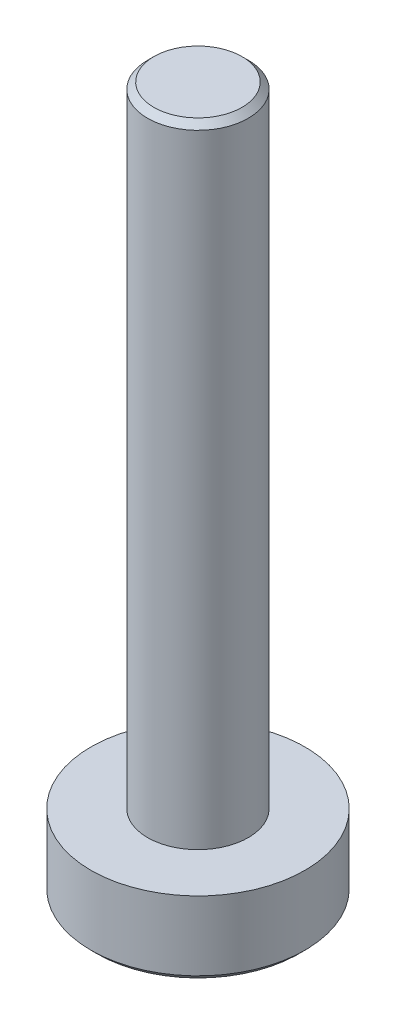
ISO-10303-21;
HEADER;
FILE_DESCRIPTION(('STEP AP214'),'2;1');
FILE_NAME('part.step','',(''),(''),'','','');
FILE_SCHEMA(('AUTOMOTIVE_DESIGN { 1 0 10303 214 1 1 1 1 }'));
ENDSEC;
DATA;
#1=APPLICATION_CONTEXT('core data for automotive mechanical design processes');
#2=APPLICATION_PROTOCOL_DEFINITION('international standard','automotive_design',2000,#1);
#3=PRODUCT_CONTEXT('',#1,'mechanical');
#4=PRODUCT('Part','Part','',(#3));
#5=PRODUCT_RELATED_PRODUCT_CATEGORY('part','',(#4));
#6=PRODUCT_DEFINITION_FORMATION('','',#4);
#7=PRODUCT_DEFINITION_CONTEXT('part definition',#1,'design');
#8=PRODUCT_DEFINITION('design','',#6,#7);
#9=PRODUCT_DEFINITION_SHAPE('','',#8);
#10=(LENGTH_UNIT() NAMED_UNIT(*) SI_UNIT(.MILLI.,.METRE.));
#11=(NAMED_UNIT(*) PLANE_ANGLE_UNIT() SI_UNIT($,.RADIAN.));
#12=(NAMED_UNIT(*) SI_UNIT($,.STERADIAN.) SOLID_ANGLE_UNIT());
#13=UNCERTAINTY_MEASURE_WITH_UNIT(LENGTH_MEASURE(1.E-05),#10,'distance_accuracy_value','');
#14=(GEOMETRIC_REPRESENTATION_CONTEXT(3) GLOBAL_UNCERTAINTY_ASSIGNED_CONTEXT((#13)) GLOBAL_UNIT_ASSIGNED_CONTEXT((#10,
#11,#12)) REPRESENTATION_CONTEXT('',''));
#15=CARTESIAN_POINT('',(0.,0.,0.));
#16=DIRECTION('',(0.,0.,1.));
#17=DIRECTION('',(1.,0.,0.));
#18=AXIS2_PLACEMENT_3D('',#15,#16,#17);
#19=CARTESIAN_POINT('',(0.,0.,0.));
#20=DIRECTION('',(0.,1.,0.));
#21=DIRECTION('',(0.,0.,1.));
#22=AXIS2_PLACEMENT_3D('',#19,#20,#21);
#23=PLANE('',#22);
#24=CARTESIAN_POINT('',(0.,0.,0.));
#25=DIRECTION('',(0.,1.,0.));
#26=DIRECTION('',(0.,0.,1.));
#27=AXIS2_PLACEMENT_3D('',#24,#25,#26);
#28=CIRCLE('',#27,8.5);
#29=CARTESIAN_POINT('',(0.,0.,8.5));
#30=VERTEX_POINT('',#29);
#31=EDGE_CURVE('E49',#30,#30,#28,.T.);
#32=ORIENTED_EDGE('',*,*,#31,.T.);
#33=EDGE_LOOP('',(#32));
#34=FACE_BOUND('',#33,.T.);
#35=CARTESIAN_POINT('',(0.,0.,0.));
#36=DIRECTION('',(0.,1.,0.));
#37=DIRECTION('',(0.,0.,1.));
#38=AXIS2_PLACEMENT_3D('',#35,#36,#37);
#39=CIRCLE('',#38,4.);
#40=CARTESIAN_POINT('',(0.,0.,4.));
#41=VERTEX_POINT('',#40);
#42=EDGE_CURVE('E52',#41,#41,#39,.T.);
#43=ORIENTED_EDGE('',*,*,#42,.F.);
#44=EDGE_LOOP('',(#43));
#45=FACE_BOUND('',#44,.T.);
#46=ADVANCED_FACE('F29',(#34,#45),#23,.T.);
#47=CARTESIAN_POINT('',(0.,-6.00000000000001,0.));
#48=DIRECTION('',(0.,1.,0.));
#49=DIRECTION('',(0.,0.,1.));
#50=AXIS2_PLACEMENT_3D('',#47,#48,#49);
#51=CYLINDRICAL_SURFACE('',#50,8.5);
#52=CARTESIAN_POINT('',(0.,-5.50000000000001,0.));
#53=DIRECTION('',(0.,1.,0.));
#54=DIRECTION('',(0.,0.,1.));
#55=AXIS2_PLACEMENT_3D('',#52,#53,#54);
#56=CIRCLE('',#55,8.5);
#57=CARTESIAN_POINT('',(0.,-5.50000000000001,8.5));
#58=VERTEX_POINT('',#57);
#59=EDGE_CURVE('E44',#58,#58,#56,.T.);
#60=ORIENTED_EDGE('',*,*,#59,.T.);
#61=EDGE_LOOP('',(#60));
#62=FACE_BOUND('',#61,.T.);
#63=ORIENTED_EDGE('',*,*,#31,.F.);
#64=EDGE_LOOP('',(#63));
#65=FACE_BOUND('',#64,.T.);
#66=ADVANCED_FACE('F31',(#62,#65),#51,.T.);
#67=CARTESIAN_POINT('',(0.,-6.00000000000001,0.));
#68=DIRECTION('',(0.,1.,0.));
#69=DIRECTION('',(0.,0.,1.));
#70=AXIS2_PLACEMENT_3D('',#67,#68,#69);
#71=PLANE('',#70);
#72=CARTESIAN_POINT('',(0.,-6.00000000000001,0.));
#73=DIRECTION('',(0.,1.,0.));
#74=DIRECTION('',(0.,0.,1.));
#75=AXIS2_PLACEMENT_3D('',#72,#73,#74);
#76=CIRCLE('',#75,8.);
#77=CARTESIAN_POINT('',(0.,-6.00000000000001,8.));
#78=VERTEX_POINT('',#77);
#79=EDGE_CURVE('E40',#78,#78,#76,.F.);
#80=ORIENTED_EDGE('',*,*,#79,.T.);
#81=EDGE_LOOP('',(#80));
#82=FACE_BOUND('',#81,.T.);
#83=ADVANCED_FACE('F64',(#82),#71,.F.);
#84=CARTESIAN_POINT('',(0.,50.,0.));
#85=DIRECTION('',(0.,-1.,0.));
#86=DIRECTION('',(0.,0.,-1.));
#87=AXIS2_PLACEMENT_3D('',#84,#85,#86);
#88=CYLINDRICAL_SURFACE('',#87,4.);
#89=CARTESIAN_POINT('',(0.,49.5,0.));
#90=DIRECTION('',(0.,1.,0.));
#91=DIRECTION('',(0.,0.,1.));
#92=AXIS2_PLACEMENT_3D('',#89,#90,#91);
#93=CIRCLE('',#92,4.);
#94=CARTESIAN_POINT('',(0.,49.5,4.));
#95=VERTEX_POINT('',#94);
#96=EDGE_CURVE('E10',#95,#95,#93,.F.);
#97=ORIENTED_EDGE('',*,*,#96,.T.);
#98=EDGE_LOOP('',(#97));
#99=FACE_BOUND('',#98,.T.);
#100=ORIENTED_EDGE('',*,*,#42,.T.);
#101=EDGE_LOOP('',(#100));
#102=FACE_BOUND('',#101,.T.);
#103=ADVANCED_FACE('F56',(#99,#102),#88,.T.);
#104=CARTESIAN_POINT('',(0.,50.,0.));
#105=DIRECTION('',(0.,1.,0.));
#106=DIRECTION('',(0.,0.,1.));
#107=AXIS2_PLACEMENT_3D('',#104,#105,#106);
#108=PLANE('',#107);
#109=CARTESIAN_POINT('',(0.,50.,0.));
#110=DIRECTION('',(0.,1.,0.));
#111=DIRECTION('',(0.,0.,1.));
#112=AXIS2_PLACEMENT_3D('',#109,#110,#111);
#113=CIRCLE('',#112,3.5);
#114=CARTESIAN_POINT('',(0.,50.,3.5));
#115=VERTEX_POINT('',#114);
#116=EDGE_CURVE('E36',#115,#115,#113,.T.);
#117=ORIENTED_EDGE('',*,*,#116,.T.);
#118=EDGE_LOOP('',(#117));
#119=FACE_BOUND('',#118,.T.);
#120=ADVANCED_FACE('F73',(#119),#108,.T.);
#121=CARTESIAN_POINT('',(0.,-5.50000000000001,0.));
#122=DIRECTION('',(0.,1.,0.));
#123=DIRECTION('',(0.,0.,1.));
#124=AXIS2_PLACEMENT_3D('',#121,#122,#123);
#125=CONICAL_SURFACE('',#124,8.5,0.785398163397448);
#126=ORIENTED_EDGE('',*,*,#79,.F.);
#127=EDGE_LOOP('',(#126));
#128=FACE_BOUND('',#127,.T.);
#129=ORIENTED_EDGE('',*,*,#59,.F.);
#130=EDGE_LOOP('',(#129));
#131=FACE_BOUND('',#130,.T.);
#132=ADVANCED_FACE('F76',(#128,#131),#125,.T.);
#133=CARTESIAN_POINT('',(0.,50.,0.));
#134=DIRECTION('',(0.,-1.,0.));
#135=DIRECTION('',(0.,0.,-1.));
#136=AXIS2_PLACEMENT_3D('',#133,#134,#135);
#137=CONICAL_SURFACE('',#136,3.5,0.785398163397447);
#138=ORIENTED_EDGE('',*,*,#96,.F.);
#139=EDGE_LOOP('',(#138));
#140=FACE_BOUND('',#139,.T.);
#141=ORIENTED_EDGE('',*,*,#116,.F.);
#142=EDGE_LOOP('',(#141));
#143=FACE_BOUND('',#142,.T.);
#144=ADVANCED_FACE('F79',(#140,#143),#137,.T.);
#145=CLOSED_SHELL('',(#46,#66,#83,#103,#120,#132,#144));
#146=MANIFOLD_SOLID_BREP('B2',#145);
#147=ADVANCED_BREP_SHAPE_REPRESENTATION('',(#18,#146),#14);
#148=SHAPE_DEFINITION_REPRESENTATION(#9,#147);
ENDSEC;
END-ISO-10303-21;
